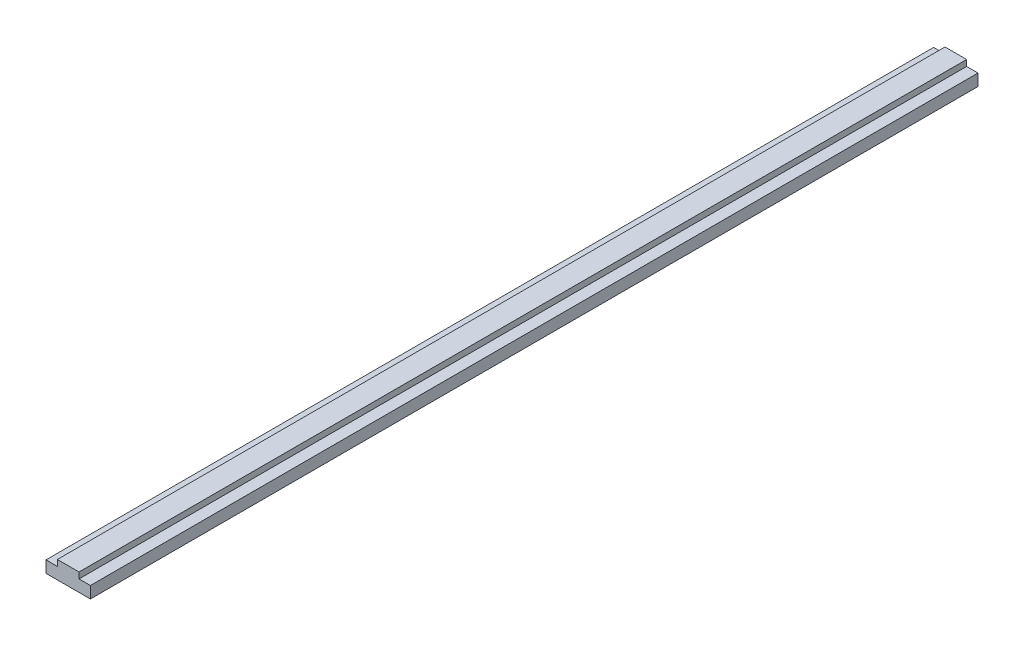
ISO-10303-21;
HEADER;
FILE_DESCRIPTION(('STEP AP214'),'2;1');
FILE_NAME('part.step','',(''),(''),'','','');
FILE_SCHEMA(('AUTOMOTIVE_DESIGN { 1 0 10303 214 1 1 1 1 }'));
ENDSEC;
DATA;
#1=APPLICATION_CONTEXT('core data for automotive mechanical design processes');
#2=APPLICATION_PROTOCOL_DEFINITION('international standard','automotive_design',2000,#1);
#3=PRODUCT_CONTEXT('',#1,'mechanical');
#4=PRODUCT('Part','Part','',(#3));
#5=PRODUCT_RELATED_PRODUCT_CATEGORY('part','',(#4));
#6=PRODUCT_DEFINITION_FORMATION('','',#4);
#7=PRODUCT_DEFINITION_CONTEXT('part definition',#1,'design');
#8=PRODUCT_DEFINITION('design','',#6,#7);
#9=PRODUCT_DEFINITION_SHAPE('','',#8);
#10=(LENGTH_UNIT() NAMED_UNIT(*) SI_UNIT(.MILLI.,.METRE.));
#11=(NAMED_UNIT(*) PLANE_ANGLE_UNIT() SI_UNIT($,.RADIAN.));
#12=(NAMED_UNIT(*) SI_UNIT($,.STERADIAN.) SOLID_ANGLE_UNIT());
#13=UNCERTAINTY_MEASURE_WITH_UNIT(LENGTH_MEASURE(1.E-05),#10,'distance_accuracy_value','');
#14=(GEOMETRIC_REPRESENTATION_CONTEXT(3) GLOBAL_UNCERTAINTY_ASSIGNED_CONTEXT((#13)) GLOBAL_UNIT_ASSIGNED_CONTEXT((#10,
#11,#12)) REPRESENTATION_CONTEXT('',''));
#15=CARTESIAN_POINT('',(0.,0.,0.));
#16=DIRECTION('',(0.,0.,1.));
#17=DIRECTION('',(1.,0.,0.));
#18=AXIS2_PLACEMENT_3D('',#15,#16,#17);
#19=CARTESIAN_POINT('',(12.5,6.60000000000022,0.));
#20=DIRECTION('',(-1.,0.,0.));
#21=DIRECTION('',(0.,0.,1.));
#22=AXIS2_PLACEMENT_3D('',#19,#20,#21);
#23=PLANE('',#22);
#24=DIRECTION('',(0.,-1.,0.));
#25=VECTOR('',#24,1.);
#26=CARTESIAN_POINT('',(12.5,6.60000000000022,500.));
#27=LINE('',#26,#25);
#28=CARTESIAN_POINT('',(12.5,6.60000000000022,500.));
#29=VERTEX_POINT('',#28);
#30=CARTESIAN_POINT('',(12.5,0.,500.));
#31=VERTEX_POINT('',#30);
#32=EDGE_CURVE('E112',#29,#31,#27,.T.);
#33=ORIENTED_EDGE('',*,*,#32,.T.);
#34=DIRECTION('',(0.,0.,1.));
#35=VECTOR('',#34,1.);
#36=CARTESIAN_POINT('',(12.5,0.,0.));
#37=LINE('',#36,#35);
#38=CARTESIAN_POINT('',(12.5,0.,0.));
#39=VERTEX_POINT('',#38);
#40=EDGE_CURVE('E9',#39,#31,#37,.T.);
#41=ORIENTED_EDGE('',*,*,#40,.F.);
#42=DIRECTION('',(0.,-1.,0.));
#43=VECTOR('',#42,1.);
#44=CARTESIAN_POINT('',(12.5,6.60000000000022,0.));
#45=LINE('',#44,#43);
#46=CARTESIAN_POINT('',(12.5,6.60000000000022,0.));
#47=VERTEX_POINT('',#46);
#48=EDGE_CURVE('E130',#47,#39,#45,.T.);
#49=ORIENTED_EDGE('',*,*,#48,.F.);
#50=DIRECTION('',(0.,0.,1.));
#51=VECTOR('',#50,1.);
#52=CARTESIAN_POINT('',(12.5,6.60000000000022,0.));
#53=LINE('',#52,#51);
#54=EDGE_CURVE('E111',#47,#29,#53,.T.);
#55=ORIENTED_EDGE('',*,*,#54,.T.);
#56=EDGE_LOOP('',(#33,#41,#49,#55));
#57=FACE_BOUND('',#56,.T.);
#58=ADVANCED_FACE('F14',(#57),#23,.F.);
#59=CARTESIAN_POINT('',(12.5,0.,0.));
#60=DIRECTION('',(0.,1.,0.));
#61=DIRECTION('',(0.,0.,1.));
#62=AXIS2_PLACEMENT_3D('',#59,#60,#61);
#63=PLANE('',#62);
#64=DIRECTION('',(-1.,0.,0.));
#65=VECTOR('',#64,1.);
#66=CARTESIAN_POINT('',(12.5,0.,500.));
#67=LINE('',#66,#65);
#68=CARTESIAN_POINT('',(-12.5,0.,500.));
#69=VERTEX_POINT('',#68);
#70=EDGE_CURVE('E115',#31,#69,#67,.T.);
#71=ORIENTED_EDGE('',*,*,#70,.T.);
#72=DIRECTION('',(0.,0.,1.));
#73=VECTOR('',#72,1.);
#74=CARTESIAN_POINT('',(-12.5,0.,0.));
#75=LINE('',#74,#73);
#76=CARTESIAN_POINT('',(-12.5,0.,0.));
#77=VERTEX_POINT('',#76);
#78=EDGE_CURVE('E22',#77,#69,#75,.T.);
#79=ORIENTED_EDGE('',*,*,#78,.F.);
#80=DIRECTION('',(-1.,0.,0.));
#81=VECTOR('',#80,1.);
#82=CARTESIAN_POINT('',(12.5,0.,0.));
#83=LINE('',#82,#81);
#84=EDGE_CURVE('E72',#39,#77,#83,.T.);
#85=ORIENTED_EDGE('',*,*,#84,.F.);
#86=ORIENTED_EDGE('',*,*,#40,.T.);
#87=EDGE_LOOP('',(#71,#79,#85,#86));
#88=FACE_BOUND('',#87,.T.);
#89=ADVANCED_FACE('F143',(#88),#63,.F.);
#90=CARTESIAN_POINT('',(-12.5,6.60000000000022,0.));
#91=DIRECTION('',(-1.,0.,0.));
#92=DIRECTION('',(0.,-1.,0.));
#93=AXIS2_PLACEMENT_3D('',#90,#91,#92);
#94=PLANE('',#93);
#95=DIRECTION('',(0.,-1.,0.));
#96=VECTOR('',#95,1.);
#97=CARTESIAN_POINT('',(-12.5,6.60000000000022,500.));
#98=LINE('',#97,#96);
#99=CARTESIAN_POINT('',(-12.5,6.60000000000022,500.));
#100=VERTEX_POINT('',#99);
#101=EDGE_CURVE('E118',#100,#69,#98,.T.);
#102=ORIENTED_EDGE('',*,*,#101,.F.);
#103=DIRECTION('',(0.,0.,1.));
#104=VECTOR('',#103,1.);
#105=CARTESIAN_POINT('',(-12.5,6.60000000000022,0.));
#106=LINE('',#105,#104);
#107=CARTESIAN_POINT('',(-12.5,6.60000000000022,0.));
#108=VERTEX_POINT('',#107);
#109=EDGE_CURVE('E136',#108,#100,#106,.T.);
#110=ORIENTED_EDGE('',*,*,#109,.F.);
#111=DIRECTION('',(0.,-1.,0.));
#112=VECTOR('',#111,1.);
#113=CARTESIAN_POINT('',(-12.5,6.60000000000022,0.));
#114=LINE('',#113,#112);
#115=EDGE_CURVE('E142',#108,#77,#114,.T.);
#116=ORIENTED_EDGE('',*,*,#115,.T.);
#117=ORIENTED_EDGE('',*,*,#78,.T.);
#118=EDGE_LOOP('',(#102,#110,#116,#117));
#119=FACE_BOUND('',#118,.T.);
#120=ADVANCED_FACE('F140',(#119),#94,.T.);
#121=CARTESIAN_POINT('',(-6.1,6.60000000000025,0.));
#122=DIRECTION('',(0.,1.,0.));
#123=DIRECTION('',(-1.,0.,0.));
#124=AXIS2_PLACEMENT_3D('',#121,#122,#123);
#125=PLANE('',#124);
#126=DIRECTION('',(-1.,0.,0.));
#127=VECTOR('',#126,1.);
#128=CARTESIAN_POINT('',(-6.1,6.60000000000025,500.));
#129=LINE('',#128,#127);
#130=CARTESIAN_POINT('',(-6.1,6.60000000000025,500.));
#131=VERTEX_POINT('',#130);
#132=EDGE_CURVE('E121',#131,#100,#129,.T.);
#133=ORIENTED_EDGE('',*,*,#132,.F.);
#134=DIRECTION('',(0.,0.,1.));
#135=VECTOR('',#134,1.);
#136=CARTESIAN_POINT('',(-6.1,6.60000000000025,0.));
#137=LINE('',#136,#135);
#138=CARTESIAN_POINT('',(-6.1,6.60000000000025,0.));
#139=VERTEX_POINT('',#138);
#140=EDGE_CURVE('E134',#139,#131,#137,.T.);
#141=ORIENTED_EDGE('',*,*,#140,.F.);
#142=DIRECTION('',(-1.,0.,0.));
#143=VECTOR('',#142,1.);
#144=CARTESIAN_POINT('',(-6.1,6.60000000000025,0.));
#145=LINE('',#144,#143);
#146=EDGE_CURVE('E106',#139,#108,#145,.T.);
#147=ORIENTED_EDGE('',*,*,#146,.T.);
#148=ORIENTED_EDGE('',*,*,#109,.T.);
#149=EDGE_LOOP('',(#133,#141,#147,#148));
#150=FACE_BOUND('',#149,.T.);
#151=ADVANCED_FACE('F151',(#150),#125,.T.);
#152=CARTESIAN_POINT('',(-6.1,10.,0.));
#153=DIRECTION('',(-1.,0.,0.));
#154=DIRECTION('',(0.,-1.,0.));
#155=AXIS2_PLACEMENT_3D('',#152,#153,#154);
#156=PLANE('',#155);
#157=DIRECTION('',(0.,-1.,0.));
#158=VECTOR('',#157,1.);
#159=CARTESIAN_POINT('',(-6.1,10.,500.));
#160=LINE('',#159,#158);
#161=CARTESIAN_POINT('',(-6.1,10.,500.));
#162=VERTEX_POINT('',#161);
#163=EDGE_CURVE('E124',#162,#131,#160,.T.);
#164=ORIENTED_EDGE('',*,*,#163,.F.);
#165=DIRECTION('',(0.,0.,1.));
#166=VECTOR('',#165,1.);
#167=CARTESIAN_POINT('',(-6.1,10.,0.));
#168=LINE('',#167,#166);
#169=CARTESIAN_POINT('',(-6.1,10.,0.));
#170=VERTEX_POINT('',#169);
#171=EDGE_CURVE('E94',#170,#162,#168,.T.);
#172=ORIENTED_EDGE('',*,*,#171,.F.);
#173=DIRECTION('',(0.,-1.,0.));
#174=VECTOR('',#173,1.);
#175=CARTESIAN_POINT('',(-6.1,10.,0.));
#176=LINE('',#175,#174);
#177=EDGE_CURVE('E104',#170,#139,#176,.T.);
#178=ORIENTED_EDGE('',*,*,#177,.T.);
#179=ORIENTED_EDGE('',*,*,#140,.T.);
#180=EDGE_LOOP('',(#164,#172,#178,#179));
#181=FACE_BOUND('',#180,.T.);
#182=ADVANCED_FACE('F183',(#181),#156,.T.);
#183=CARTESIAN_POINT('',(6.1,10.,0.));
#184=DIRECTION('',(0.,1.,0.));
#185=DIRECTION('',(0.,0.,1.));
#186=AXIS2_PLACEMENT_3D('',#183,#184,#185);
#187=PLANE('',#186);
#188=DIRECTION('',(-1.,0.,0.));
#189=VECTOR('',#188,1.);
#190=CARTESIAN_POINT('',(6.1,10.,500.));
#191=LINE('',#190,#189);
#192=CARTESIAN_POINT('',(6.1,10.,500.));
#193=VERTEX_POINT('',#192);
#194=EDGE_CURVE('E93',#193,#162,#191,.T.);
#195=ORIENTED_EDGE('',*,*,#194,.F.);
#196=DIRECTION('',(0.,0.,1.));
#197=VECTOR('',#196,1.);
#198=CARTESIAN_POINT('',(6.1,10.,0.));
#199=LINE('',#198,#197);
#200=CARTESIAN_POINT('',(6.1,10.,0.));
#201=VERTEX_POINT('',#200);
#202=EDGE_CURVE('E87',#201,#193,#199,.T.);
#203=ORIENTED_EDGE('',*,*,#202,.F.);
#204=DIRECTION('',(-1.,0.,0.));
#205=VECTOR('',#204,1.);
#206=CARTESIAN_POINT('',(6.1,10.,0.));
#207=LINE('',#206,#205);
#208=EDGE_CURVE('E91',#201,#170,#207,.T.);
#209=ORIENTED_EDGE('',*,*,#208,.T.);
#210=ORIENTED_EDGE('',*,*,#171,.T.);
#211=EDGE_LOOP('',(#195,#203,#209,#210));
#212=FACE_BOUND('',#211,.T.);
#213=ADVANCED_FACE('F89',(#212),#187,.T.);
#214=CARTESIAN_POINT('',(6.1,10.,0.));
#215=DIRECTION('',(-1.,0.,0.));
#216=DIRECTION('',(0.,0.,1.));
#217=AXIS2_PLACEMENT_3D('',#214,#215,#216);
#218=PLANE('',#217);
#219=DIRECTION('',(0.,-1.,0.));
#220=VECTOR('',#219,1.);
#221=CARTESIAN_POINT('',(6.1,10.,500.));
#222=LINE('',#221,#220);
#223=CARTESIAN_POINT('',(6.1,6.60000000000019,500.));
#224=VERTEX_POINT('',#223);
#225=EDGE_CURVE('E58',#193,#224,#222,.T.);
#226=ORIENTED_EDGE('',*,*,#225,.T.);
#227=DIRECTION('',(0.,0.,1.));
#228=VECTOR('',#227,1.);
#229=CARTESIAN_POINT('',(6.1,6.60000000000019,0.));
#230=LINE('',#229,#228);
#231=CARTESIAN_POINT('',(6.1,6.60000000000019,0.));
#232=VERTEX_POINT('',#231);
#233=EDGE_CURVE('E95',#232,#224,#230,.T.);
#234=ORIENTED_EDGE('',*,*,#233,.F.);
#235=DIRECTION('',(0.,-1.,0.));
#236=VECTOR('',#235,1.);
#237=CARTESIAN_POINT('',(6.1,10.,0.));
#238=LINE('',#237,#236);
#239=EDGE_CURVE('E97',#201,#232,#238,.T.);
#240=ORIENTED_EDGE('',*,*,#239,.F.);
#241=ORIENTED_EDGE('',*,*,#202,.T.);
#242=EDGE_LOOP('',(#226,#234,#240,#241));
#243=FACE_BOUND('',#242,.T.);
#244=ADVANCED_FACE('F98',(#243),#218,.F.);
#245=CARTESIAN_POINT('',(6.1,6.60000000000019,0.));
#246=DIRECTION('',(0.,-1.,0.));
#247=DIRECTION('',(1.,0.,0.));
#248=AXIS2_PLACEMENT_3D('',#245,#246,#247);
#249=PLANE('',#248);
#250=DIRECTION('',(1.,0.,0.));
#251=VECTOR('',#250,1.);
#252=CARTESIAN_POINT('',(6.1,6.60000000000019,500.));
#253=LINE('',#252,#251);
#254=EDGE_CURVE('E64',#224,#29,#253,.T.);
#255=ORIENTED_EDGE('',*,*,#254,.T.);
#256=ORIENTED_EDGE('',*,*,#54,.F.);
#257=DIRECTION('',(1.,0.,0.));
#258=VECTOR('',#257,1.);
#259=CARTESIAN_POINT('',(6.1,6.60000000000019,0.));
#260=LINE('',#259,#258);
#261=EDGE_CURVE('E30',#232,#47,#260,.T.);
#262=ORIENTED_EDGE('',*,*,#261,.F.);
#263=ORIENTED_EDGE('',*,*,#233,.T.);
#264=EDGE_LOOP('',(#255,#256,#262,#263));
#265=FACE_BOUND('',#264,.T.);
#266=ADVANCED_FACE('F158',(#265),#249,.F.);
#267=CARTESIAN_POINT('',(12.5,0.,0.));
#268=DIRECTION('',(0.,0.,-1.));
#269=DIRECTION('',(-1.,0.,0.));
#270=AXIS2_PLACEMENT_3D('',#267,#268,#269);
#271=PLANE('',#270);
#272=ORIENTED_EDGE('',*,*,#48,.T.);
#273=ORIENTED_EDGE('',*,*,#84,.T.);
#274=ORIENTED_EDGE('',*,*,#115,.F.);
#275=ORIENTED_EDGE('',*,*,#146,.F.);
#276=ORIENTED_EDGE('',*,*,#177,.F.);
#277=ORIENTED_EDGE('',*,*,#208,.F.);
#278=ORIENTED_EDGE('',*,*,#239,.T.);
#279=ORIENTED_EDGE('',*,*,#261,.T.);
#280=EDGE_LOOP('',(#272,#273,#274,#275,#276,#277,#278,#279));
#281=FACE_BOUND('',#280,.T.);
#282=ADVANCED_FACE('F101',(#281),#271,.T.);
#283=CARTESIAN_POINT('',(12.5,0.,500.));
#284=DIRECTION('',(0.,0.,-1.));
#285=DIRECTION('',(-1.,0.,0.));
#286=AXIS2_PLACEMENT_3D('',#283,#284,#285);
#287=PLANE('',#286);
#288=ORIENTED_EDGE('',*,*,#32,.F.);
#289=ORIENTED_EDGE('',*,*,#254,.F.);
#290=ORIENTED_EDGE('',*,*,#225,.F.);
#291=ORIENTED_EDGE('',*,*,#194,.T.);
#292=ORIENTED_EDGE('',*,*,#163,.T.);
#293=ORIENTED_EDGE('',*,*,#132,.T.);
#294=ORIENTED_EDGE('',*,*,#101,.T.);
#295=ORIENTED_EDGE('',*,*,#70,.F.);
#296=EDGE_LOOP('',(#288,#289,#290,#291,#292,#293,#294,#295));
#297=FACE_BOUND('',#296,.T.);
#298=ADVANCED_FACE('F147',(#297),#287,.F.);
#299=CLOSED_SHELL('',(#58,#89,#120,#151,#182,#213,#244,#266,#282,#298));
#300=MANIFOLD_SOLID_BREP('B1',#299);
#301=ADVANCED_BREP_SHAPE_REPRESENTATION('',(#18,#300),#14);
#302=SHAPE_DEFINITION_REPRESENTATION(#9,#301);
ENDSEC;
END-ISO-10303-21;
